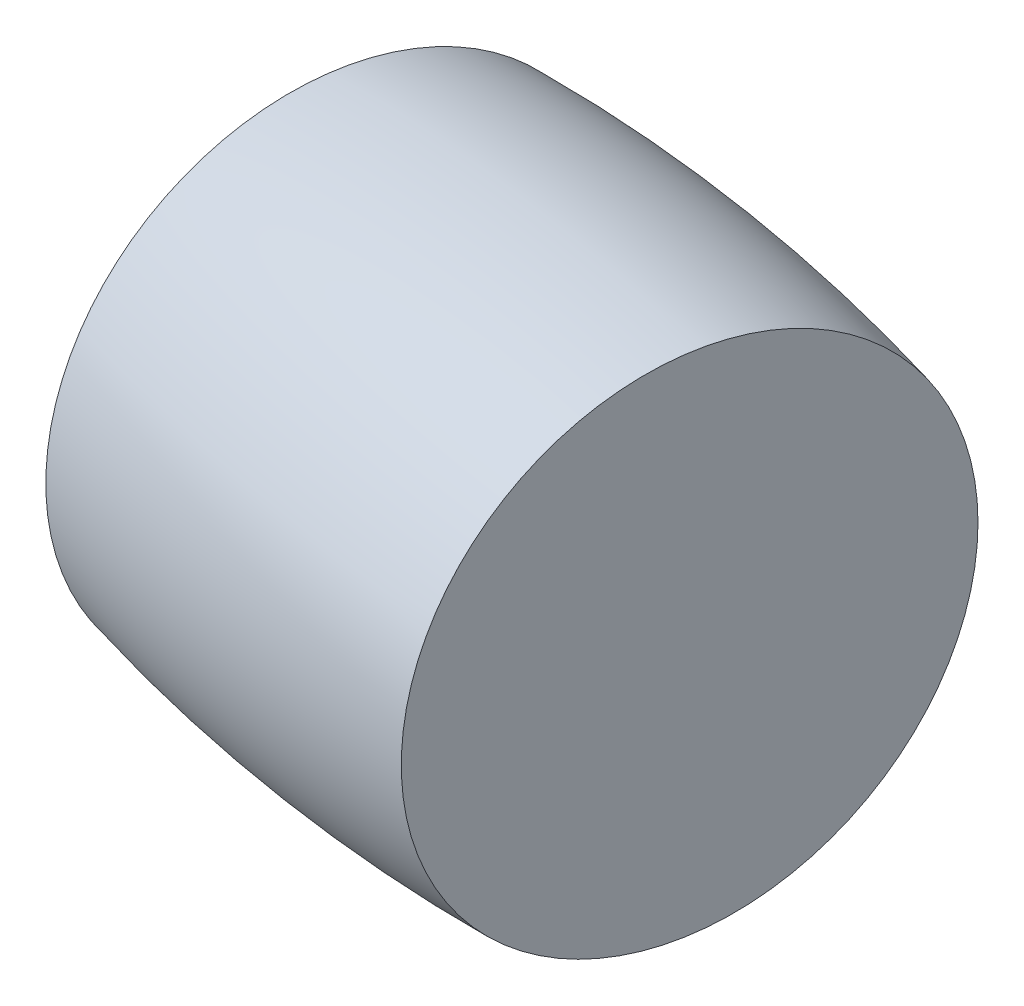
from build123d import *


with BuildPart() as part:
    # Esquisse1 → Base-R_volution (revolve)
    with BuildSketch(Plane(origin=(0, 0, 0), x_dir=(1, 0, 0), z_dir=(0, 1, 0))):
        with BuildLine():
            Line((-8.433853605, 1.325200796), (-6.86770721, 11.292482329))
            ThreePointArc((-6.86770721, 11.292482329), (1.641816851, 10.448864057), (10, 8.642080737))
            Line((10, 8.642080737), (8.433853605, -1.325200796))
            Line((8.433853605, -1.325200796), (-8.433853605, 1.325200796))
        make_face()
    revolve(axis=Axis((8.433853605, 0, 1.325200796), (-0.987879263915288, 0, -0.15522422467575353)))


solid = part.part
